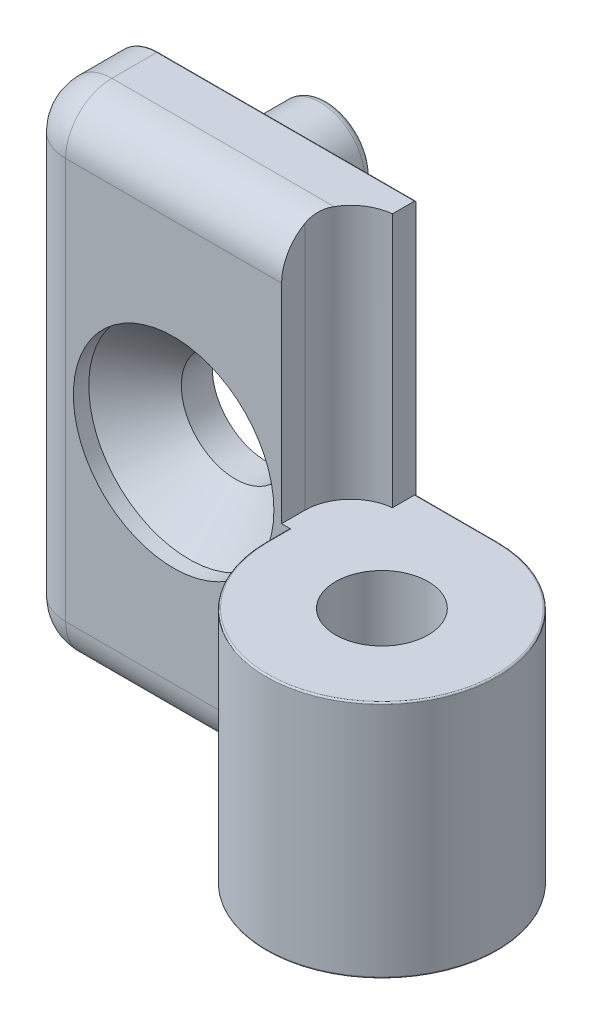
ISO-10303-21;
HEADER;
FILE_DESCRIPTION(('STEP AP214'),'2;1');
FILE_NAME('part.step','',(''),(''),'','','');
FILE_SCHEMA(('AUTOMOTIVE_DESIGN { 1 0 10303 214 1 1 1 1 }'));
ENDSEC;
DATA;
#1=APPLICATION_CONTEXT('core data for automotive mechanical design processes');
#2=APPLICATION_PROTOCOL_DEFINITION('international standard','automotive_design',2000,#1);
#3=PRODUCT_CONTEXT('',#1,'mechanical');
#4=PRODUCT('Part','Part','',(#3));
#5=PRODUCT_RELATED_PRODUCT_CATEGORY('part','',(#4));
#6=PRODUCT_DEFINITION_FORMATION('','',#4);
#7=PRODUCT_DEFINITION_CONTEXT('part definition',#1,'design');
#8=PRODUCT_DEFINITION('design','',#6,#7);
#9=PRODUCT_DEFINITION_SHAPE('','',#8);
#10=(LENGTH_UNIT() NAMED_UNIT(*) SI_UNIT(.MILLI.,.METRE.));
#11=(NAMED_UNIT(*) PLANE_ANGLE_UNIT() SI_UNIT($,.RADIAN.));
#12=(NAMED_UNIT(*) SI_UNIT($,.STERADIAN.) SOLID_ANGLE_UNIT());
#13=UNCERTAINTY_MEASURE_WITH_UNIT(LENGTH_MEASURE(1.E-05),#10,'distance_accuracy_value','');
#14=(GEOMETRIC_REPRESENTATION_CONTEXT(3) GLOBAL_UNCERTAINTY_ASSIGNED_CONTEXT((#13)) GLOBAL_UNIT_ASSIGNED_CONTEXT((#10,
#11,#12)) REPRESENTATION_CONTEXT('',''));
#15=CARTESIAN_POINT('',(0.,0.,0.));
#16=DIRECTION('',(0.,0.,1.));
#17=DIRECTION('',(1.,0.,0.));
#18=AXIS2_PLACEMENT_3D('',#15,#16,#17);
#19=CARTESIAN_POINT('',(-7.59999999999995,15.5,-7.49999999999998));
#20=DIRECTION('',(0.,0.,1.));
#21=DIRECTION('',(1.,0.,0.));
#22=AXIS2_PLACEMENT_3D('',#19,#20,#21);
#23=PLANE('',#22);
#24=CARTESIAN_POINT('',(-15.0000000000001,16.,-7.49999999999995));
#25=DIRECTION('',(0.,0.,1.));
#26=DIRECTION('',(1.,0.,0.));
#27=AXIS2_PLACEMENT_3D('',#24,#25,#26);
#28=CIRCLE('',#27,3.5);
#29=CARTESIAN_POINT('',(-11.5000000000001,16.,-7.49999999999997));
#30=VERTEX_POINT('',#29);
#31=EDGE_CURVE('E180',#30,#30,#28,.T.);
#32=ORIENTED_EDGE('',*,*,#31,.T.);
#33=EDGE_LOOP('',(#32));
#34=FACE_BOUND('',#33,.T.);
#35=CARTESIAN_POINT('',(-15.0000000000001,28.,-7.49999999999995));
#36=DIRECTION('',(0.,0.,1.));
#37=DIRECTION('',(1.,0.,0.));
#38=AXIS2_PLACEMENT_3D('',#35,#36,#37);
#39=CIRCLE('',#38,2.9);
#40=CARTESIAN_POINT('',(-12.1000000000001,28.,-7.49999999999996));
#41=VERTEX_POINT('',#40);
#42=EDGE_CURVE('E228',#41,#41,#39,.F.);
#43=ORIENTED_EDGE('',*,*,#42,.F.);
#44=EDGE_LOOP('',(#43));
#45=FACE_BOUND('',#44,.T.);
#46=CARTESIAN_POINT('',(-22.0000000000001,29.,-7.49999999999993));
#47=DIRECTION('',(0.,0.,1.));
#48=DIRECTION('',(1.,0.,0.));
#49=AXIS2_PLACEMENT_3D('',#46,#47,#48);
#50=CIRCLE('',#49,2.9);
#51=CARTESIAN_POINT('',(-24.9000000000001,29.,-7.49999999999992));
#52=VERTEX_POINT('',#51);
#53=CARTESIAN_POINT('',(-22.0000000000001,31.9,-7.49999999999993));
#54=VERTEX_POINT('',#53);
#55=EDGE_CURVE('E459',#52,#54,#50,.F.);
#56=ORIENTED_EDGE('',*,*,#55,.T.);
#57=DIRECTION('',(1.,0.,0.));
#58=VECTOR('',#57,1.);
#59=CARTESIAN_POINT('',(-5.30000000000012,31.9,-7.49999999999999));
#60=LINE('',#59,#58);
#61=CARTESIAN_POINT('',(-5.30000000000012,31.9,-7.49999999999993));
#62=VERTEX_POINT('',#61);
#63=EDGE_CURVE('E461',#54,#62,#60,.T.);
#64=ORIENTED_EDGE('',*,*,#63,.T.);
#65=DIRECTION('',(0.,-1.,0.));
#66=VECTOR('',#65,1.);
#67=CARTESIAN_POINT('',(-5.30000000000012,32.,-7.49999999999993));
#68=LINE('',#67,#66);
#69=CARTESIAN_POINT('',(-5.30000000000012,15.4,-7.49999999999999));
#70=VERTEX_POINT('',#69);
#71=EDGE_CURVE('E207',#62,#70,#68,.T.);
#72=ORIENTED_EDGE('',*,*,#71,.T.);
#73=DIRECTION('',(-1.,0.,0.));
#74=VECTOR('',#73,1.);
#75=CARTESIAN_POINT('',(-7.59999999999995,15.4,-7.49999999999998));
#76=LINE('',#75,#74);
#77=CARTESIAN_POINT('',(0.,15.4,-7.50000000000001));
#78=VERTEX_POINT('',#77);
#79=EDGE_CURVE('E450',#70,#78,#76,.F.);
#80=ORIENTED_EDGE('',*,*,#79,.T.);
#81=DIRECTION('',(0.,-1.,0.));
#82=VECTOR('',#81,1.);
#83=CARTESIAN_POINT('',(0.,15.5,-7.50000000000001));
#84=LINE('',#83,#82);
#85=CARTESIAN_POINT('',(0.,0.0999999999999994,-7.50000000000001));
#86=VERTEX_POINT('',#85);
#87=EDGE_CURVE('E223',#78,#86,#84,.T.);
#88=ORIENTED_EDGE('',*,*,#87,.T.);
#89=DIRECTION('',(-1.,0.,0.));
#90=VECTOR('',#89,1.);
#91=CARTESIAN_POINT('',(-22.0000000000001,0.0999999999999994,-7.49999999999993));
#92=LINE('',#91,#90);
#93=CARTESIAN_POINT('',(-22.0000000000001,0.0999999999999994,-7.49999999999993));
#94=VERTEX_POINT('',#93);
#95=EDGE_CURVE('E445',#86,#94,#92,.T.);
#96=ORIENTED_EDGE('',*,*,#95,.T.);
#97=CARTESIAN_POINT('',(-22.0000000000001,3.,-7.49999999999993));
#98=DIRECTION('',(0.,0.,1.));
#99=DIRECTION('',(1.,0.,0.));
#100=AXIS2_PLACEMENT_3D('',#97,#98,#99);
#101=CIRCLE('',#100,2.9);
#102=CARTESIAN_POINT('',(-24.9000000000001,3.,-7.49999999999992));
#103=VERTEX_POINT('',#102);
#104=EDGE_CURVE('E449',#94,#103,#101,.F.);
#105=ORIENTED_EDGE('',*,*,#104,.T.);
#106=DIRECTION('',(0.,-1.,0.));
#107=VECTOR('',#106,1.);
#108=CARTESIAN_POINT('',(-24.9000000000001,29.,-7.49999999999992));
#109=LINE('',#108,#107);
#110=EDGE_CURVE('E452',#103,#52,#109,.F.);
#111=ORIENTED_EDGE('',*,*,#110,.T.);
#112=EDGE_LOOP('',(#56,#64,#72,#80,#88,#96,#105,#111));
#113=FACE_BOUND('',#112,.T.);
#114=CARTESIAN_POINT('',(-15.0000000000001,4.,-7.49999999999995));
#115=DIRECTION('',(0.,0.,1.));
#116=DIRECTION('',(1.,0.,0.));
#117=AXIS2_PLACEMENT_3D('',#114,#115,#116);
#118=CIRCLE('',#117,2.9);
#119=CARTESIAN_POINT('',(-12.1000000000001,4.,-7.49999999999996));
#120=VERTEX_POINT('',#119);
#121=EDGE_CURVE('E231',#120,#120,#118,.F.);
#122=ORIENTED_EDGE('',*,*,#121,.F.);
#123=EDGE_LOOP('',(#122));
#124=FACE_BOUND('',#123,.T.);
#125=ADVANCED_FACE('F37',(#34,#45,#113,#124),#23,.F.);
#126=CARTESIAN_POINT('',(0.,15.5,0.));
#127=DIRECTION('',(0.,-1.,0.));
#128=DIRECTION('',(0.,0.,-1.));
#129=AXIS2_PLACEMENT_3D('',#126,#127,#128);
#130=CYLINDRICAL_SURFACE('',#129,7.49999999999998);
#131=DIRECTION('',(0.,-1.,0.));
#132=VECTOR('',#131,1.);
#133=CARTESIAN_POINT('',(-7.49999999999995,15.5,0.));
#134=LINE('',#133,#132);
#135=CARTESIAN_POINT('',(-7.49999999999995,15.4,0.));
#136=VERTEX_POINT('',#135);
#137=CARTESIAN_POINT('',(-7.49999999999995,0.0999999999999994,0.));
#138=VERTEX_POINT('',#137);
#139=EDGE_CURVE('E216',#136,#138,#134,.T.);
#140=ORIENTED_EDGE('',*,*,#139,.T.);
#141=CARTESIAN_POINT('',(0.,0.0999999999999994,0.));
#142=DIRECTION('',(0.,-1.,0.));
#143=DIRECTION('',(0.,0.,-1.));
#144=AXIS2_PLACEMENT_3D('',#141,#142,#143);
#145=CIRCLE('',#144,7.49999999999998);
#146=EDGE_CURVE('E367',#138,#86,#145,.F.);
#147=ORIENTED_EDGE('',*,*,#146,.T.);
#148=ORIENTED_EDGE('',*,*,#87,.F.);
#149=CARTESIAN_POINT('',(0.,15.4,0.));
#150=DIRECTION('',(0.,-1.,0.));
#151=DIRECTION('',(0.,0.,-1.));
#152=AXIS2_PLACEMENT_3D('',#149,#150,#151);
#153=CIRCLE('',#152,7.49999999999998);
#154=EDGE_CURVE('E413',#78,#136,#153,.T.);
#155=ORIENTED_EDGE('',*,*,#154,.T.);
#156=EDGE_LOOP('',(#140,#147,#148,#155));
#157=FACE_BOUND('',#156,.T.);
#158=ADVANCED_FACE('F327',(#157),#130,.T.);
#159=CARTESIAN_POINT('',(-7.59999999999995,15.5,-1.49999999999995));
#160=DIRECTION('',(0.,0.,-1.));
#161=DIRECTION('',(-1.,0.,0.));
#162=AXIS2_PLACEMENT_3D('',#159,#160,#161);
#163=PLANE('',#162);
#164=CARTESIAN_POINT('',(-15.0000000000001,16.,-1.49999999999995));
#165=DIRECTION('',(0.,0.,1.));
#166=DIRECTION('',(1.,0.,0.));
#167=AXIS2_PLACEMENT_3D('',#164,#165,#166);
#168=CIRCLE('',#167,6.5);
#169=CARTESIAN_POINT('',(-8.50000000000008,16.,-1.49999999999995));
#170=VERTEX_POINT('',#169);
#171=EDGE_CURVE('E533',#170,#170,#168,.T.);
#172=ORIENTED_EDGE('',*,*,#171,.F.);
#173=EDGE_LOOP('',(#172));
#174=FACE_BOUND('',#173,.T.);
#175=DIRECTION('',(0.,-1.,0.));
#176=VECTOR('',#175,1.);
#177=CARTESIAN_POINT('',(-22.0000000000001,32.,-1.49999999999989));
#178=LINE('',#177,#176);
#179=CARTESIAN_POINT('',(-22.0000000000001,29.,-1.49999999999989));
#180=VERTEX_POINT('',#179);
#181=CARTESIAN_POINT('',(-22.0000000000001,3.,-1.49999999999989));
#182=VERTEX_POINT('',#181);
#183=EDGE_CURVE('E204',#180,#182,#178,.T.);
#184=ORIENTED_EDGE('',*,*,#183,.T.);
#185=DIRECTION('',(1.,0.,0.));
#186=VECTOR('',#185,1.);
#187=CARTESIAN_POINT('',(-7.49999999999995,3.,-1.49999999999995));
#188=LINE('',#187,#186);
#189=CARTESIAN_POINT('',(-7.49999999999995,3.,-1.49999999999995));
#190=VERTEX_POINT('',#189);
#191=EDGE_CURVE('E269',#182,#190,#188,.T.);
#192=ORIENTED_EDGE('',*,*,#191,.T.);
#193=DIRECTION('',(0.,-1.,0.));
#194=VECTOR('',#193,1.);
#195=CARTESIAN_POINT('',(-7.49999999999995,15.5,-1.49999999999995));
#196=LINE('',#195,#194);
#197=CARTESIAN_POINT('',(-7.49999999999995,15.4,-1.49999999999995));
#198=VERTEX_POINT('',#197);
#199=EDGE_CURVE('E221',#198,#190,#196,.T.);
#200=ORIENTED_EDGE('',*,*,#199,.F.);
#201=CARTESIAN_POINT('',(-7.39999999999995,15.4,-1.49999999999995));
#202=DIRECTION('',(0.,0.,-1.));
#203=DIRECTION('',(-1.,0.,0.));
#204=AXIS2_PLACEMENT_3D('',#201,#202,#203);
#205=CIRCLE('',#204,0.1);
#206=CARTESIAN_POINT('',(-7.39999999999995,15.5,-1.49999999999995));
#207=VERTEX_POINT('',#206);
#208=EDGE_CURVE('E46',#198,#207,#205,.T.);
#209=ORIENTED_EDGE('',*,*,#208,.T.);
#210=DIRECTION('',(1.,0.,0.));
#211=VECTOR('',#210,1.);
#212=CARTESIAN_POINT('',(-7.59999999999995,15.5,-1.49999999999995));
#213=LINE('',#212,#211);
#214=CARTESIAN_POINT('',(-8.00000000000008,15.5,-1.49999999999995));
#215=VERTEX_POINT('',#214);
#216=EDGE_CURVE('E54',#215,#207,#213,.T.);
#217=ORIENTED_EDGE('',*,*,#216,.F.);
#218=DIRECTION('',(0.,1.,0.));
#219=VECTOR('',#218,1.);
#220=CARTESIAN_POINT('',(-8.00000000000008,15.5,-1.49999999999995));
#221=LINE('',#220,#219);
#222=CARTESIAN_POINT('',(-8.00000000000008,29.,-1.49999999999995));
#223=VERTEX_POINT('',#222);
#224=EDGE_CURVE('E190',#215,#223,#221,.T.);
#225=ORIENTED_EDGE('',*,*,#224,.T.);
#226=DIRECTION('',(-1.,0.,0.));
#227=VECTOR('',#226,1.);
#228=CARTESIAN_POINT('',(-22.0000000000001,29.,-1.49999999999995));
#229=LINE('',#228,#227);
#230=EDGE_CURVE('E267',#223,#180,#229,.T.);
#231=ORIENTED_EDGE('',*,*,#230,.T.);
#232=EDGE_LOOP('',(#184,#192,#200,#209,#217,#225,#231));
#233=FACE_BOUND('',#232,.T.);
#234=ADVANCED_FACE('F323',(#174,#233),#163,.F.);
#235=CARTESIAN_POINT('',(-7.49999999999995,15.5,0.));
#236=DIRECTION('',(1.,0.,0.));
#237=DIRECTION('',(0.,0.,-1.));
#238=AXIS2_PLACEMENT_3D('',#235,#236,#237);
#239=PLANE('',#238);
#240=CARTESIAN_POINT('',(-7.49999999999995,3.,-4.49999999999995));
#241=DIRECTION('',(1.,0.,0.));
#242=DIRECTION('',(0.,0.,-1.));
#243=AXIS2_PLACEMENT_3D('',#240,#241,#242);
#244=CIRCLE('',#243,3.);
#245=CARTESIAN_POINT('',(-7.49999999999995,0.0999999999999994,-3.73188542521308));
#246=VERTEX_POINT('',#245);
#247=EDGE_CURVE('E516',#190,#246,#244,.T.);
#248=ORIENTED_EDGE('',*,*,#247,.T.);
#249=DIRECTION('',(0.,0.,1.));
#250=VECTOR('',#249,1.);
#251=CARTESIAN_POINT('',(-7.49999999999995,0.0999999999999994,0.));
#252=LINE('',#251,#250);
#253=EDGE_CURVE('E515',#246,#138,#252,.T.);
#254=ORIENTED_EDGE('',*,*,#253,.T.);
#255=ORIENTED_EDGE('',*,*,#139,.F.);
#256=DIRECTION('',(0.,0.,1.));
#257=VECTOR('',#256,1.);
#258=CARTESIAN_POINT('',(-7.49999999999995,15.4,0.));
#259=LINE('',#258,#257);
#260=EDGE_CURVE('E513',#136,#198,#259,.F.);
#261=ORIENTED_EDGE('',*,*,#260,.T.);
#262=ORIENTED_EDGE('',*,*,#199,.T.);
#263=EDGE_LOOP('',(#248,#254,#255,#261,#262));
#264=FACE_BOUND('',#263,.T.);
#265=ADVANCED_FACE('F317',(#264),#239,.F.);
#266=CARTESIAN_POINT('',(0.,15.5,0.));
#267=DIRECTION('',(0.,-1.,0.));
#268=DIRECTION('',(0.,0.,-1.));
#269=AXIS2_PLACEMENT_3D('',#266,#267,#268);
#270=PLANE('',#269);
#271=ORIENTED_EDGE('',*,*,#216,.T.);
#272=DIRECTION('',(0.,0.,1.));
#273=VECTOR('',#272,1.);
#274=CARTESIAN_POINT('',(-7.39999999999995,15.5,0.));
#275=LINE('',#274,#273);
#276=CARTESIAN_POINT('',(-7.39999999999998,15.5,0.));
#277=VERTEX_POINT('',#276);
#278=EDGE_CURVE('E476',#207,#277,#275,.T.);
#279=ORIENTED_EDGE('',*,*,#278,.T.);
#280=CARTESIAN_POINT('',(0.,15.5,0.));
#281=DIRECTION('',(0.,-1.,0.));
#282=DIRECTION('',(0.,0.,-1.));
#283=AXIS2_PLACEMENT_3D('',#280,#281,#282);
#284=CIRCLE('',#283,7.39999999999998);
#285=CARTESIAN_POINT('',(0.,15.5,-7.39999999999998));
#286=VERTEX_POINT('',#285);
#287=EDGE_CURVE('E60',#277,#286,#284,.F.);
#288=ORIENTED_EDGE('',*,*,#287,.T.);
#289=DIRECTION('',(-1.,0.,0.));
#290=VECTOR('',#289,1.);
#291=CARTESIAN_POINT('',(0.,15.5,-7.40000000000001));
#292=LINE('',#291,#290);
#293=CARTESIAN_POINT('',(-5.30000000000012,15.5,-7.39999999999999));
#294=VERTEX_POINT('',#293);
#295=EDGE_CURVE('E474',#286,#294,#292,.T.);
#296=ORIENTED_EDGE('',*,*,#295,.T.);
#297=DIRECTION('',(0.,0.,1.));
#298=VECTOR('',#297,1.);
#299=CARTESIAN_POINT('',(-5.30000000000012,15.5,0.));
#300=LINE('',#299,#298);
#301=CARTESIAN_POINT('',(-5.30000000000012,15.5,-5.98496231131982));
#302=VERTEX_POINT('',#301);
#303=EDGE_CURVE('E176',#294,#302,#300,.T.);
#304=ORIENTED_EDGE('',*,*,#303,.T.);
#305=CARTESIAN_POINT('',(-5.00000000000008,15.5,-2.99999999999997));
#306=DIRECTION('',(0.,1.,0.));
#307=DIRECTION('',(0.,0.,1.));
#308=AXIS2_PLACEMENT_3D('',#305,#306,#307);
#309=CIRCLE('',#308,3.);
#310=CARTESIAN_POINT('',(-8.00000000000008,15.5,-2.99999999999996));
#311=VERTEX_POINT('',#310);
#312=EDGE_CURVE('E169',#302,#311,#309,.T.);
#313=ORIENTED_EDGE('',*,*,#312,.T.);
#314=DIRECTION('',(0.,0.,1.));
#315=VECTOR('',#314,1.);
#316=CARTESIAN_POINT('',(-8.00000000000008,15.5,-2.99999999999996));
#317=LINE('',#316,#315);
#318=EDGE_CURVE('E174',#311,#215,#317,.T.);
#319=ORIENTED_EDGE('',*,*,#318,.T.);
#320=EDGE_LOOP('',(#271,#279,#288,#296,#304,#313,#319));
#321=FACE_BOUND('',#320,.T.);
#322=CARTESIAN_POINT('',(0.,15.5,0.));
#323=DIRECTION('',(0.,1.,0.));
#324=DIRECTION('',(0.,0.,1.));
#325=AXIS2_PLACEMENT_3D('',#322,#323,#324);
#326=CIRCLE('',#325,3.);
#327=CARTESIAN_POINT('',(0.,15.5,3.));
#328=VERTEX_POINT('',#327);
#329=EDGE_CURVE('E212',#328,#328,#326,.T.);
#330=ORIENTED_EDGE('',*,*,#329,.F.);
#331=EDGE_LOOP('',(#330));
#332=FACE_BOUND('',#331,.T.);
#333=ADVANCED_FACE('F171',(#321,#332),#270,.F.);
#334=CARTESIAN_POINT('',(0.,0.,0.));
#335=DIRECTION('',(0.,-1.,0.));
#336=DIRECTION('',(0.,0.,-1.));
#337=AXIS2_PLACEMENT_3D('',#334,#335,#336);
#338=PLANE('',#337);
#339=DIRECTION('',(0.,0.,1.));
#340=VECTOR('',#339,1.);
#341=CARTESIAN_POINT('',(-7.39999999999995,0.,-4.49999999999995));
#342=LINE('',#341,#340);
#343=CARTESIAN_POINT('',(-7.39999999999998,0.,0.));
#344=VERTEX_POINT('',#343);
#345=CARTESIAN_POINT('',(-7.39999999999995,0.,-4.49999999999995));
#346=VERTEX_POINT('',#345);
#347=EDGE_CURVE('E454',#344,#346,#342,.F.);
#348=ORIENTED_EDGE('',*,*,#347,.T.);
#349=DIRECTION('',(1.,0.,0.));
#350=VECTOR('',#349,1.);
#351=CARTESIAN_POINT('',(-22.0000000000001,0.,-4.49999999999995));
#352=LINE('',#351,#350);
#353=CARTESIAN_POINT('',(-22.0000000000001,0.,-4.49999999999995));
#354=VERTEX_POINT('',#353);
#355=EDGE_CURVE('E246',#346,#354,#352,.F.);
#356=ORIENTED_EDGE('',*,*,#355,.T.);
#357=DIRECTION('',(0.,0.,-1.));
#358=VECTOR('',#357,1.);
#359=CARTESIAN_POINT('',(-22.0000000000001,0.,0.));
#360=LINE('',#359,#358);
#361=CARTESIAN_POINT('',(-22.0000000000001,0.,-7.39999999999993));
#362=VERTEX_POINT('',#361);
#363=EDGE_CURVE('E251',#354,#362,#360,.T.);
#364=ORIENTED_EDGE('',*,*,#363,.T.);
#365=DIRECTION('',(-1.,0.,0.));
#366=VECTOR('',#365,1.);
#367=CARTESIAN_POINT('',(0.,0.,-7.40000000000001));
#368=LINE('',#367,#366);
#369=CARTESIAN_POINT('',(0.,0.,-7.39999999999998));
#370=VERTEX_POINT('',#369);
#371=EDGE_CURVE('E444',#362,#370,#368,.F.);
#372=ORIENTED_EDGE('',*,*,#371,.T.);
#373=CARTESIAN_POINT('',(0.,0.,0.));
#374=DIRECTION('',(0.,-1.,0.));
#375=DIRECTION('',(0.,0.,-1.));
#376=AXIS2_PLACEMENT_3D('',#373,#374,#375);
#377=CIRCLE('',#376,7.39999999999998);
#378=EDGE_CURVE('E441',#370,#344,#377,.T.);
#379=ORIENTED_EDGE('',*,*,#378,.T.);
#380=EDGE_LOOP('',(#348,#356,#364,#372,#379));
#381=FACE_BOUND('',#380,.T.);
#382=ADVANCED_FACE('F313',(#381),#338,.T.);
#383=CARTESIAN_POINT('',(0.,2.,0.));
#384=DIRECTION('',(0.,1.,0.));
#385=DIRECTION('',(0.,0.,1.));
#386=AXIS2_PLACEMENT_3D('',#383,#384,#385);
#387=CYLINDRICAL_SURFACE('',#386,3.);
#388=CARTESIAN_POINT('',(0.,2.,0.));
#389=DIRECTION('',(0.,1.,0.));
#390=DIRECTION('',(0.,0.,1.));
#391=AXIS2_PLACEMENT_3D('',#388,#389,#390);
#392=CIRCLE('',#391,3.);
#393=CARTESIAN_POINT('',(0.,2.,3.));
#394=VERTEX_POINT('',#393);
#395=EDGE_CURVE('E213',#394,#394,#392,.T.);
#396=ORIENTED_EDGE('',*,*,#395,.F.);
#397=EDGE_LOOP('',(#396));
#398=FACE_BOUND('',#397,.T.);
#399=ORIENTED_EDGE('',*,*,#329,.T.);
#400=EDGE_LOOP('',(#399));
#401=FACE_BOUND('',#400,.T.);
#402=ADVANCED_FACE('F309',(#398,#401),#387,.F.);
#403=CARTESIAN_POINT('',(0.,2.,0.));
#404=DIRECTION('',(0.,1.,0.));
#405=DIRECTION('',(0.,0.,1.));
#406=AXIS2_PLACEMENT_3D('',#403,#404,#405);
#407=PLANE('',#406);
#408=ORIENTED_EDGE('',*,*,#395,.T.);
#409=EDGE_LOOP('',(#408));
#410=FACE_BOUND('',#409,.T.);
#411=ADVANCED_FACE('F299',(#410),#407,.T.);
#412=CARTESIAN_POINT('',(-5.30000000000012,32.,-1.49999999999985));
#413=DIRECTION('',(1.,0.,0.));
#414=DIRECTION('',(0.,0.,-1.));
#415=AXIS2_PLACEMENT_3D('',#412,#413,#414);
#416=PLANE('',#415);
#417=ORIENTED_EDGE('',*,*,#71,.F.);
#418=CARTESIAN_POINT('',(-5.30000000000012,31.9,-7.39999999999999));
#419=DIRECTION('',(1.,0.,0.));
#420=DIRECTION('',(0.,0.,-1.));
#421=AXIS2_PLACEMENT_3D('',#418,#419,#420);
#422=CIRCLE('',#421,0.1);
#423=CARTESIAN_POINT('',(-5.30000000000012,32.,-7.39999999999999));
#424=VERTEX_POINT('',#423);
#425=EDGE_CURVE('E463',#62,#424,#422,.T.);
#426=ORIENTED_EDGE('',*,*,#425,.T.);
#427=DIRECTION('',(0.,0.,1.));
#428=VECTOR('',#427,1.);
#429=CARTESIAN_POINT('',(-5.30000000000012,32.,-1.49999999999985));
#430=LINE('',#429,#428);
#431=CARTESIAN_POINT('',(-5.30000000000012,32.,-5.98496231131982));
#432=VERTEX_POINT('',#431);
#433=EDGE_CURVE('E201',#424,#432,#430,.T.);
#434=ORIENTED_EDGE('',*,*,#433,.T.);
#435=DIRECTION('',(0.,1.,0.));
#436=VECTOR('',#435,1.);
#437=CARTESIAN_POINT('',(-5.30000000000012,15.5,-5.98496231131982));
#438=LINE('',#437,#436);
#439=EDGE_CURVE('E198',#302,#432,#438,.T.);
#440=ORIENTED_EDGE('',*,*,#439,.F.);
#441=ORIENTED_EDGE('',*,*,#303,.F.);
#442=CARTESIAN_POINT('',(-5.30000000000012,15.4,-7.39999999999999));
#443=DIRECTION('',(1.,0.,0.));
#444=DIRECTION('',(0.,0.,-1.));
#445=AXIS2_PLACEMENT_3D('',#442,#443,#444);
#446=CIRCLE('',#445,0.1);
#447=EDGE_CURVE('E11',#294,#70,#446,.F.);
#448=ORIENTED_EDGE('',*,*,#447,.T.);
#449=EDGE_LOOP('',(#417,#426,#434,#440,#441,#448));
#450=FACE_BOUND('',#449,.T.);
#451=ADVANCED_FACE('F295',(#450),#416,.T.);
#452=CARTESIAN_POINT('',(-22.0000000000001,32.,-4.49999999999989));
#453=DIRECTION('',(0.,-1.,0.));
#454=DIRECTION('',(0.,0.,-1.));
#455=AXIS2_PLACEMENT_3D('',#452,#453,#454);
#456=CYLINDRICAL_SURFACE('',#455,3.);
#457=DIRECTION('',(0.,-1.,0.));
#458=VECTOR('',#457,1.);
#459=CARTESIAN_POINT('',(-25.0000000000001,32.,-4.49999999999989));
#460=LINE('',#459,#458);
#461=CARTESIAN_POINT('',(-25.0000000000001,29.,-4.49999999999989));
#462=VERTEX_POINT('',#461);
#463=CARTESIAN_POINT('',(-25.0000000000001,3.,-4.49999999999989));
#464=VERTEX_POINT('',#463);
#465=EDGE_CURVE('E203',#462,#464,#460,.T.);
#466=ORIENTED_EDGE('',*,*,#465,.T.);
#467=CARTESIAN_POINT('',(-22.0000000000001,3.,-4.49999999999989));
#468=DIRECTION('',(0.,-1.,0.));
#469=DIRECTION('',(0.,0.,-1.));
#470=AXIS2_PLACEMENT_3D('',#467,#468,#469);
#471=CIRCLE('',#470,3.);
#472=EDGE_CURVE('E261',#464,#182,#471,.F.);
#473=ORIENTED_EDGE('',*,*,#472,.T.);
#474=ORIENTED_EDGE('',*,*,#183,.F.);
#475=CARTESIAN_POINT('',(-22.0000000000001,29.,-4.49999999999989));
#476=DIRECTION('',(0.,-1.,0.));
#477=DIRECTION('',(0.,0.,-1.));
#478=AXIS2_PLACEMENT_3D('',#475,#476,#477);
#479=CIRCLE('',#478,3.);
#480=EDGE_CURVE('E259',#180,#462,#479,.T.);
#481=ORIENTED_EDGE('',*,*,#480,.T.);
#482=EDGE_LOOP('',(#466,#473,#474,#481));
#483=FACE_BOUND('',#482,.T.);
#484=ADVANCED_FACE('F298',(#483),#456,.T.);
#485=CARTESIAN_POINT('',(-25.0000000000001,32.,-4.49999999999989));
#486=DIRECTION('',(-1.,0.,0.));
#487=DIRECTION('',(0.,0.,1.));
#488=AXIS2_PLACEMENT_3D('',#485,#486,#487);
#489=PLANE('',#488);
#490=DIRECTION('',(0.,0.,-1.));
#491=VECTOR('',#490,1.);
#492=CARTESIAN_POINT('',(-25.0000000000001,29.,-4.49999999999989));
#493=LINE('',#492,#491);
#494=CARTESIAN_POINT('',(-25.0000000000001,29.,-7.39999999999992));
#495=VERTEX_POINT('',#494);
#496=EDGE_CURVE('E254',#462,#495,#493,.T.);
#497=ORIENTED_EDGE('',*,*,#496,.T.);
#498=DIRECTION('',(0.,-1.,0.));
#499=VECTOR('',#498,1.);
#500=CARTESIAN_POINT('',(-25.0000000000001,3.,-7.39999999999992));
#501=LINE('',#500,#499);
#502=CARTESIAN_POINT('',(-25.0000000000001,3.,-7.39999999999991));
#503=VERTEX_POINT('',#502);
#504=EDGE_CURVE('E469',#495,#503,#501,.T.);
#505=ORIENTED_EDGE('',*,*,#504,.T.);
#506=DIRECTION('',(0.,0.,-1.));
#507=VECTOR('',#506,1.);
#508=CARTESIAN_POINT('',(-25.0000000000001,3.,-4.49999999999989));
#509=LINE('',#508,#507);
#510=EDGE_CURVE('E257',#503,#464,#509,.F.);
#511=ORIENTED_EDGE('',*,*,#510,.T.);
#512=ORIENTED_EDGE('',*,*,#465,.F.);
#513=EDGE_LOOP('',(#497,#505,#511,#512));
#514=FACE_BOUND('',#513,.T.);
#515=ADVANCED_FACE('F293',(#514),#489,.T.);
#516=CARTESIAN_POINT('',(-22.0000000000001,32.,-4.49999999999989));
#517=DIRECTION('',(0.,1.,0.));
#518=DIRECTION('',(0.,0.,1.));
#519=AXIS2_PLACEMENT_3D('',#516,#517,#518);
#520=PLANE('',#519);
#521=ORIENTED_EDGE('',*,*,#433,.F.);
#522=DIRECTION('',(1.,0.,0.));
#523=VECTOR('',#522,1.);
#524=CARTESIAN_POINT('',(-22.0000000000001,32.,-7.39999999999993));
#525=LINE('',#524,#523);
#526=CARTESIAN_POINT('',(-22.0000000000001,32.,-7.39999999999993));
#527=VERTEX_POINT('',#526);
#528=EDGE_CURVE('E465',#424,#527,#525,.F.);
#529=ORIENTED_EDGE('',*,*,#528,.T.);
#530=DIRECTION('',(0.,0.,-1.));
#531=VECTOR('',#530,1.);
#532=CARTESIAN_POINT('',(-22.0000000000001,32.,-4.49999999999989));
#533=LINE('',#532,#531);
#534=CARTESIAN_POINT('',(-22.0000000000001,32.,-4.49999999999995));
#535=VERTEX_POINT('',#534);
#536=EDGE_CURVE('E265',#527,#535,#533,.F.);
#537=ORIENTED_EDGE('',*,*,#536,.T.);
#538=DIRECTION('',(-1.,0.,0.));
#539=VECTOR('',#538,1.);
#540=CARTESIAN_POINT('',(-8.00000000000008,32.,-4.49999999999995));
#541=LINE('',#540,#539);
#542=CARTESIAN_POINT('',(-7.59807621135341,32.,-4.49999999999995));
#543=VERTEX_POINT('',#542);
#544=EDGE_CURVE('E263',#535,#543,#541,.F.);
#545=ORIENTED_EDGE('',*,*,#544,.T.);
#546=CARTESIAN_POINT('',(-5.00000000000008,32.,-2.99999999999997));
#547=DIRECTION('',(0.,1.,0.));
#548=DIRECTION('',(0.,0.,1.));
#549=AXIS2_PLACEMENT_3D('',#546,#547,#548);
#550=CIRCLE('',#549,3.);
#551=EDGE_CURVE('E226',#432,#543,#550,.T.);
#552=ORIENTED_EDGE('',*,*,#551,.F.);
#553=EDGE_LOOP('',(#521,#529,#537,#545,#552));
#554=FACE_BOUND('',#553,.T.);
#555=ADVANCED_FACE('F290',(#554),#520,.T.);
#556=CARTESIAN_POINT('',(-8.00000000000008,15.5,-2.99999999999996));
#557=DIRECTION('',(-1.,0.,0.));
#558=DIRECTION('',(0.,0.,1.));
#559=AXIS2_PLACEMENT_3D('',#556,#557,#558);
#560=PLANE('',#559);
#561=DIRECTION('',(0.,1.,0.));
#562=VECTOR('',#561,1.);
#563=CARTESIAN_POINT('',(-8.00000000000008,15.5,-2.99999999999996));
#564=LINE('',#563,#562);
#565=CARTESIAN_POINT('',(-8.00000000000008,31.5980762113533,-2.99999999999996));
#566=VERTEX_POINT('',#565);
#567=EDGE_CURVE('E183',#311,#566,#564,.T.);
#568=ORIENTED_EDGE('',*,*,#567,.T.);
#569=CARTESIAN_POINT('',(-8.00000000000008,29.,-4.49999999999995));
#570=DIRECTION('',(-1.,0.,0.));
#571=DIRECTION('',(0.,0.,1.));
#572=AXIS2_PLACEMENT_3D('',#569,#570,#571);
#573=CIRCLE('',#572,3.);
#574=EDGE_CURVE('E278',#566,#223,#573,.F.);
#575=ORIENTED_EDGE('',*,*,#574,.T.);
#576=ORIENTED_EDGE('',*,*,#224,.F.);
#577=ORIENTED_EDGE('',*,*,#318,.F.);
#578=EDGE_LOOP('',(#568,#575,#576,#577));
#579=FACE_BOUND('',#578,.T.);
#580=ADVANCED_FACE('F192',(#579),#560,.F.);
#581=CARTESIAN_POINT('',(-5.00000000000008,15.5,-2.99999999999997));
#582=DIRECTION('',(0.,1.,0.));
#583=DIRECTION('',(0.,0.,1.));
#584=AXIS2_PLACEMENT_3D('',#581,#582,#583);
#585=CYLINDRICAL_SURFACE('',#584,3.);
#586=ORIENTED_EDGE('',*,*,#551,.T.);
#587=CARTESIAN_POINT('',(-7.59807621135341,32.,-4.49999999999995));
#588=CARTESIAN_POINT('',(-7.62988153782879,32.0000087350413,-4.44493424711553));
#589=CARTESIAN_POINT('',(-7.65992254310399,31.9984838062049,-4.3888355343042));
#590=CARTESIAN_POINT('',(-7.71632995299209,31.9920904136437,-4.27497922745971));
#591=CARTESIAN_POINT('',(-7.74269488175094,31.9872206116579,-4.21722097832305));
#592=CARTESIAN_POINT('',(-7.79157242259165,31.9738624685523,-4.10051183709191));
#593=CARTESIAN_POINT('',(-7.81408598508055,31.965375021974,-4.04156124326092));
#594=CARTESIAN_POINT('',(-7.8551763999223,31.9446035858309,-3.92299061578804));
#595=CARTESIAN_POINT('',(-7.87375409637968,31.9323204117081,-3.86337072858));
#596=CARTESIAN_POINT('',(-7.92362207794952,31.8894923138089,-3.68396374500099));
#597=CARTESIAN_POINT('',(-7.94895852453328,31.8529917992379,-3.56384396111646));
#598=CARTESIAN_POINT('',(-7.98445398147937,31.7642902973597,-3.327568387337));
#599=CARTESIAN_POINT('',(-7.99464917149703,31.7121270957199,-3.21140379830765));
#600=CARTESIAN_POINT('',(-7.99891590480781,31.6439914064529,-3.08237184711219));
#601=CARTESIAN_POINT('',(-7.99932471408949,31.635022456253,-3.06577028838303));
#602=CARTESIAN_POINT('',(-7.99986635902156,31.6167793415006,-3.0327511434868));
#603=CARTESIAN_POINT('',(-7.99999944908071,31.607505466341,-3.01633340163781));
#604=CARTESIAN_POINT('',(-8.00000000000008,31.5980762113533,-2.99999999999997));
#605=B_SPLINE_CURVE_WITH_KNOTS('',3,(#587,#588,#589,#590,#591,#592,#593,#594,#595,#596,#597,
#598,#599,#600,#601,#602,#603,#604),.UNSPECIFIED.,.F.,.F.,(4,2,2,2,2,2,2,2,4),(0.,
0.190739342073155,0.381555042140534,0.572323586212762,0.763051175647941,1.14519682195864,
1.52642786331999,1.58304875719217,1.63961738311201),.UNSPECIFIED.);
#606=EDGE_CURVE('E187',#543,#566,#605,.T.);
#607=ORIENTED_EDGE('',*,*,#606,.T.);
#608=ORIENTED_EDGE('',*,*,#567,.F.);
#609=ORIENTED_EDGE('',*,*,#312,.F.);
#610=ORIENTED_EDGE('',*,*,#439,.T.);
#611=EDGE_LOOP('',(#586,#607,#608,#609,#610));
#612=FACE_BOUND('',#611,.T.);
#613=ADVANCED_FACE('F185',(#612),#585,.F.);
#614=CARTESIAN_POINT('',(-15.0000000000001,28.,-11.5));
#615=DIRECTION('',(0.,0.,1.));
#616=DIRECTION('',(1.,0.,0.));
#617=AXIS2_PLACEMENT_3D('',#614,#615,#616);
#618=CYLINDRICAL_SURFACE('',#617,2.9);
#619=CARTESIAN_POINT('',(-15.0000000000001,28.,-11.));
#620=DIRECTION('',(0.,0.,-1.));
#621=DIRECTION('',(-1.,0.,0.));
#622=AXIS2_PLACEMENT_3D('',#619,#620,#621);
#623=CIRCLE('',#622,2.9);
#624=CARTESIAN_POINT('',(-17.9000000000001,28.,-10.9999999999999));
#625=VERTEX_POINT('',#624);
#626=EDGE_CURVE('E237',#625,#625,#623,.F.);
#627=ORIENTED_EDGE('',*,*,#626,.T.);
#628=EDGE_LOOP('',(#627));
#629=FACE_BOUND('',#628,.T.);
#630=ORIENTED_EDGE('',*,*,#42,.T.);
#631=EDGE_LOOP('',(#630));
#632=FACE_BOUND('',#631,.T.);
#633=ADVANCED_FACE('F288',(#629,#632),#618,.T.);
#634=CARTESIAN_POINT('',(-15.0000000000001,28.,-11.5));
#635=DIRECTION('',(0.,0.,-1.));
#636=DIRECTION('',(-1.,0.,0.));
#637=AXIS2_PLACEMENT_3D('',#634,#635,#636);
#638=PLANE('',#637);
#639=CARTESIAN_POINT('',(-15.0000000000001,28.,-11.5));
#640=DIRECTION('',(0.,0.,-1.));
#641=DIRECTION('',(-1.,0.,0.));
#642=AXIS2_PLACEMENT_3D('',#639,#640,#641);
#643=CIRCLE('',#642,2.);
#644=CARTESIAN_POINT('',(-17.0000000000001,28.,-11.4999999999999));
#645=VERTEX_POINT('',#644);
#646=EDGE_CURVE('E507',#645,#645,#643,.T.);
#647=ORIENTED_EDGE('',*,*,#646,.F.);
#648=EDGE_LOOP('',(#647));
#649=FACE_BOUND('',#648,.T.);
#650=CARTESIAN_POINT('',(-15.0000000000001,28.,-11.5));
#651=DIRECTION('',(0.,0.,-1.));
#652=DIRECTION('',(-1.,0.,0.));
#653=AXIS2_PLACEMENT_3D('',#650,#651,#652);
#654=CIRCLE('',#653,2.4);
#655=CARTESIAN_POINT('',(-17.4000000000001,28.,-11.4999999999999));
#656=VERTEX_POINT('',#655);
#657=EDGE_CURVE('E234',#656,#656,#654,.T.);
#658=ORIENTED_EDGE('',*,*,#657,.T.);
#659=EDGE_LOOP('',(#658));
#660=FACE_BOUND('',#659,.T.);
#661=ADVANCED_FACE('F570',(#649,#660),#638,.T.);
#662=CARTESIAN_POINT('',(-15.0000000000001,4.,-11.5));
#663=DIRECTION('',(0.,0.,1.));
#664=DIRECTION('',(1.,0.,0.));
#665=AXIS2_PLACEMENT_3D('',#662,#663,#664);
#666=CYLINDRICAL_SURFACE('',#665,2.9);
#667=CARTESIAN_POINT('',(-15.0000000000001,4.,-11.));
#668=DIRECTION('',(0.,0.,-1.));
#669=DIRECTION('',(-1.,0.,0.));
#670=AXIS2_PLACEMENT_3D('',#667,#668,#669);
#671=CIRCLE('',#670,2.9);
#672=CARTESIAN_POINT('',(-17.9000000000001,4.,-10.9999999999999));
#673=VERTEX_POINT('',#672);
#674=EDGE_CURVE('E243',#673,#673,#671,.F.);
#675=ORIENTED_EDGE('',*,*,#674,.T.);
#676=EDGE_LOOP('',(#675));
#677=FACE_BOUND('',#676,.T.);
#678=ORIENTED_EDGE('',*,*,#121,.T.);
#679=EDGE_LOOP('',(#678));
#680=FACE_BOUND('',#679,.T.);
#681=ADVANCED_FACE('F566',(#677,#680),#666,.T.);
#682=CARTESIAN_POINT('',(-15.0000000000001,4.,-11.5));
#683=DIRECTION('',(0.,0.,-1.));
#684=DIRECTION('',(-1.,0.,0.));
#685=AXIS2_PLACEMENT_3D('',#682,#683,#684);
#686=PLANE('',#685);
#687=CARTESIAN_POINT('',(-15.0000000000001,4.,-11.5));
#688=DIRECTION('',(0.,0.,-1.));
#689=DIRECTION('',(-1.,0.,0.));
#690=AXIS2_PLACEMENT_3D('',#687,#688,#689);
#691=CIRCLE('',#690,2.);
#692=CARTESIAN_POINT('',(-17.0000000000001,4.,-11.4999999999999));
#693=VERTEX_POINT('',#692);
#694=EDGE_CURVE('E425',#693,#693,#691,.T.);
#695=ORIENTED_EDGE('',*,*,#694,.F.);
#696=EDGE_LOOP('',(#695));
#697=FACE_BOUND('',#696,.T.);
#698=CARTESIAN_POINT('',(-15.0000000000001,4.,-11.5));
#699=DIRECTION('',(0.,0.,-1.));
#700=DIRECTION('',(-1.,0.,0.));
#701=AXIS2_PLACEMENT_3D('',#698,#699,#700);
#702=CIRCLE('',#701,2.4);
#703=CARTESIAN_POINT('',(-17.4000000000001,4.,-11.4999999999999));
#704=VERTEX_POINT('',#703);
#705=EDGE_CURVE('E240',#704,#704,#702,.T.);
#706=ORIENTED_EDGE('',*,*,#705,.T.);
#707=EDGE_LOOP('',(#706));
#708=FACE_BOUND('',#707,.T.);
#709=ADVANCED_FACE('F339',(#697,#708),#686,.T.);
#710=CARTESIAN_POINT('',(-15.0000000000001,28.,-11.));
#711=DIRECTION('',(0.,0.,-1.));
#712=DIRECTION('',(-1.,0.,0.));
#713=AXIS2_PLACEMENT_3D('',#710,#711,#712);
#714=TOROIDAL_SURFACE('',#713,2.4,0.5);
#715=ORIENTED_EDGE('',*,*,#626,.F.);
#716=EDGE_LOOP('',(#715));
#717=FACE_BOUND('',#716,.T.);
#718=ORIENTED_EDGE('',*,*,#657,.F.);
#719=EDGE_LOOP('',(#718));
#720=FACE_BOUND('',#719,.T.);
#721=ADVANCED_FACE('F335',(#717,#720),#714,.T.);
#722=CARTESIAN_POINT('',(-15.0000000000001,4.,-11.));
#723=DIRECTION('',(0.,0.,-1.));
#724=DIRECTION('',(-1.,0.,0.));
#725=AXIS2_PLACEMENT_3D('',#722,#723,#724);
#726=TOROIDAL_SURFACE('',#725,2.4,0.5);
#727=ORIENTED_EDGE('',*,*,#674,.F.);
#728=EDGE_LOOP('',(#727));
#729=FACE_BOUND('',#728,.T.);
#730=ORIENTED_EDGE('',*,*,#705,.F.);
#731=EDGE_LOOP('',(#730));
#732=FACE_BOUND('',#731,.T.);
#733=ADVANCED_FACE('F338',(#729,#732),#726,.T.);
#734=CARTESIAN_POINT('',(-15.0000000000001,16.,-1.49999999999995));
#735=DIRECTION('',(0.,0.,1.));
#736=DIRECTION('',(1.,0.,0.));
#737=AXIS2_PLACEMENT_3D('',#734,#735,#736);
#738=CYLINDRICAL_SURFACE('',#737,3.5);
#739=CARTESIAN_POINT('',(-15.0000000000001,16.,-5.49999999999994));
#740=DIRECTION('',(0.,0.,1.));
#741=DIRECTION('',(1.,0.,0.));
#742=AXIS2_PLACEMENT_3D('',#739,#740,#741);
#743=CIRCLE('',#742,3.5);
#744=CARTESIAN_POINT('',(-11.5000000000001,16.,-5.49999999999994));
#745=VERTEX_POINT('',#744);
#746=EDGE_CURVE('E249',#745,#745,#743,.T.);
#747=ORIENTED_EDGE('',*,*,#746,.T.);
#748=EDGE_LOOP('',(#747));
#749=FACE_BOUND('',#748,.T.);
#750=ORIENTED_EDGE('',*,*,#31,.F.);
#751=EDGE_LOOP('',(#750));
#752=FACE_BOUND('',#751,.T.);
#753=ADVANCED_FACE('F343',(#749,#752),#738,.F.);
#754=CARTESIAN_POINT('',(-15.0000000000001,16.,-2.49999999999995));
#755=DIRECTION('',(0.,0.,1.));
#756=DIRECTION('',(1.,0.,0.));
#757=AXIS2_PLACEMENT_3D('',#754,#755,#756);
#758=CONICAL_SURFACE('',#757,6.5,0.785398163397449);
#759=ORIENTED_EDGE('',*,*,#746,.F.);
#760=EDGE_LOOP('',(#759));
#761=FACE_BOUND('',#760,.T.);
#762=CARTESIAN_POINT('',(-15.0000000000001,16.,-2.49999999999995));
#763=DIRECTION('',(0.,0.,1.));
#764=DIRECTION('',(1.,0.,0.));
#765=AXIS2_PLACEMENT_3D('',#762,#763,#764);
#766=CIRCLE('',#765,6.5);
#767=CARTESIAN_POINT('',(-8.50000000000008,16.,-2.49999999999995));
#768=VERTEX_POINT('',#767);
#769=EDGE_CURVE('E536',#768,#768,#766,.T.);
#770=ORIENTED_EDGE('',*,*,#769,.T.);
#771=EDGE_LOOP('',(#770));
#772=FACE_BOUND('',#771,.T.);
#773=ADVANCED_FACE('F548',(#761,#772),#758,.F.);
#774=CARTESIAN_POINT('',(-15.0000000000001,16.,-1.49999999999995));
#775=DIRECTION('',(0.,0.,1.));
#776=DIRECTION('',(1.,0.,0.));
#777=AXIS2_PLACEMENT_3D('',#774,#775,#776);
#778=CYLINDRICAL_SURFACE('',#777,6.5);
#779=ORIENTED_EDGE('',*,*,#769,.F.);
#780=EDGE_LOOP('',(#779));
#781=FACE_BOUND('',#780,.T.);
#782=ORIENTED_EDGE('',*,*,#171,.T.);
#783=EDGE_LOOP('',(#782));
#784=FACE_BOUND('',#783,.T.);
#785=ADVANCED_FACE('F357',(#781,#784),#778,.F.);
#786=CARTESIAN_POINT('',(-7.59999999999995,3.,-4.49999999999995));
#787=DIRECTION('',(-1.,0.,0.));
#788=DIRECTION('',(0.,0.,1.));
#789=AXIS2_PLACEMENT_3D('',#786,#787,#788);
#790=CYLINDRICAL_SURFACE('',#789,3.);
#791=ORIENTED_EDGE('',*,*,#247,.F.);
#792=ORIENTED_EDGE('',*,*,#191,.F.);
#793=CARTESIAN_POINT('',(-22.0000000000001,3.,-4.49999999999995));
#794=DIRECTION('',(-1.,0.,0.));
#795=DIRECTION('',(0.,0.,1.));
#796=AXIS2_PLACEMENT_3D('',#793,#794,#795);
#797=CIRCLE('',#796,3.);
#798=EDGE_CURVE('E510',#354,#182,#797,.T.);
#799=ORIENTED_EDGE('',*,*,#798,.F.);
#800=ORIENTED_EDGE('',*,*,#355,.F.);
#801=CARTESIAN_POINT('',(-7.49999999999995,0.0999999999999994,-3.73188542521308));
#802=CARTESIAN_POINT('',(-7.49995931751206,0.0914367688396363,-3.76421228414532));
#803=CARTESIAN_POINT('',(-7.49890643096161,0.0834229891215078,-3.79665536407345));
#804=CARTESIAN_POINT('',(-7.49522991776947,0.0685033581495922,-3.86169097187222));
#805=CARTESIAN_POINT('',(-7.49260718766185,0.0615968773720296,-3.89428340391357));
#806=CARTESIAN_POINT('',(-7.48488191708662,0.0461723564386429,-3.97354188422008));
#807=CARTESIAN_POINT('',(-7.47919847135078,0.0382295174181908,-4.02026169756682));
#808=CARTESIAN_POINT('',(-7.46633353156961,0.0245828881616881,-4.1138263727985));
#809=CARTESIAN_POINT('',(-7.45915140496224,0.0188800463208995,-4.16067127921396));
#810=CARTESIAN_POINT('',(-7.43622741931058,0.00510101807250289,-4.30135309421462));
#811=CARTESIAN_POINT('',(-7.41910940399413,0.000356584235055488,-4.39532543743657));
#812=CARTESIAN_POINT('',(-7.40131159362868,6.45372220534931E-06,-4.49281589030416));
#813=CARTESIAN_POINT('',(-7.40065576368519,2.7178186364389E-09,-4.49640800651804));
#814=CARTESIAN_POINT('',(-7.39999999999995,0.,-4.49999999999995));
#815=B_SPLINE_CURVE_WITH_KNOTS('',3,(#801,#802,#803,#804,#805,#806,#807,#808,#809,#810,#811,
#812,#813,#814),.UNSPECIFIED.,.F.,.F.,(4,2,2,2,2,2,4),(0.,0.10026555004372,0.200473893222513,
0.34356655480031,0.486719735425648,0.773061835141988,0.784016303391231),.UNSPECIFIED.);
#816=EDGE_CURVE('E361',#346,#246,#815,.F.);
#817=ORIENTED_EDGE('',*,*,#816,.T.);
#818=EDGE_LOOP('',(#791,#792,#799,#800,#817));
#819=FACE_BOUND('',#818,.T.);
#820=ADVANCED_FACE('F352',(#819),#790,.T.);
#821=CARTESIAN_POINT('',(-22.0000000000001,3.,-4.49999999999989));
#822=DIRECTION('',(0.,0.,1.));
#823=DIRECTION('',(1.,0.,0.));
#824=AXIS2_PLACEMENT_3D('',#821,#822,#823);
#825=SPHERICAL_SURFACE('',#824,3.);
#826=ORIENTED_EDGE('',*,*,#798,.T.);
#827=ORIENTED_EDGE('',*,*,#472,.F.);
#828=CARTESIAN_POINT('',(-22.0000000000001,3.,-4.49999999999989));
#829=DIRECTION('',(0.,0.,-1.));
#830=DIRECTION('',(-1.,0.,0.));
#831=AXIS2_PLACEMENT_3D('',#828,#829,#830);
#832=CIRCLE('',#831,3.);
#833=EDGE_CURVE('E500',#354,#464,#832,.T.);
#834=ORIENTED_EDGE('',*,*,#833,.F.);
#835=EDGE_LOOP('',(#826,#827,#834));
#836=FACE_BOUND('',#835,.T.);
#837=ADVANCED_FACE('F348',(#836),#825,.T.);
#838=CARTESIAN_POINT('',(-22.0000000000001,3.,0.));
#839=DIRECTION('',(0.,0.,-1.));
#840=DIRECTION('',(-1.,0.,0.));
#841=AXIS2_PLACEMENT_3D('',#838,#839,#840);
#842=CYLINDRICAL_SURFACE('',#841,3.);
#843=ORIENTED_EDGE('',*,*,#510,.F.);
#844=CARTESIAN_POINT('',(-22.0000000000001,3.,-7.39999999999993));
#845=DIRECTION('',(0.,0.,1.));
#846=DIRECTION('',(1.,0.,0.));
#847=AXIS2_PLACEMENT_3D('',#844,#845,#846);
#848=CIRCLE('',#847,3.);
#849=EDGE_CURVE('E471',#503,#362,#848,.T.);
#850=ORIENTED_EDGE('',*,*,#849,.T.);
#851=ORIENTED_EDGE('',*,*,#363,.F.);
#852=ORIENTED_EDGE('',*,*,#833,.T.);
#853=EDGE_LOOP('',(#843,#850,#851,#852));
#854=FACE_BOUND('',#853,.T.);
#855=ADVANCED_FACE('F345',(#854),#842,.T.);
#856=CARTESIAN_POINT('',(-7.59999999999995,29.,-4.49999999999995));
#857=DIRECTION('',(1.,0.,0.));
#858=DIRECTION('',(0.,0.,-1.));
#859=AXIS2_PLACEMENT_3D('',#856,#857,#858);
#860=CYLINDRICAL_SURFACE('',#859,3.);
#861=CARTESIAN_POINT('',(-22.0000000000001,29.,-4.49999999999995));
#862=DIRECTION('',(-1.,0.,0.));
#863=DIRECTION('',(0.,0.,1.));
#864=AXIS2_PLACEMENT_3D('',#861,#862,#863);
#865=CIRCLE('',#864,3.);
#866=EDGE_CURVE('E492',#180,#535,#865,.T.);
#867=ORIENTED_EDGE('',*,*,#866,.F.);
#868=ORIENTED_EDGE('',*,*,#230,.F.);
#869=ORIENTED_EDGE('',*,*,#574,.F.);
#870=ORIENTED_EDGE('',*,*,#606,.F.);
#871=ORIENTED_EDGE('',*,*,#544,.F.);
#872=EDGE_LOOP('',(#867,#868,#869,#870,#871));
#873=FACE_BOUND('',#872,.T.);
#874=ADVANCED_FACE('F280',(#873),#860,.T.);
#875=CARTESIAN_POINT('',(-22.0000000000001,29.,-4.49999999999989));
#876=DIRECTION('',(0.,0.,1.));
#877=DIRECTION('',(1.,0.,0.));
#878=AXIS2_PLACEMENT_3D('',#875,#876,#877);
#879=SPHERICAL_SURFACE('',#878,3.);
#880=ORIENTED_EDGE('',*,*,#480,.F.);
#881=ORIENTED_EDGE('',*,*,#866,.T.);
#882=CARTESIAN_POINT('',(-22.0000000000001,29.,-4.49999999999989));
#883=DIRECTION('',(0.,0.,-1.));
#884=DIRECTION('',(-1.,0.,0.));
#885=AXIS2_PLACEMENT_3D('',#882,#883,#884);
#886=CIRCLE('',#885,3.);
#887=EDGE_CURVE('E498',#462,#535,#886,.T.);
#888=ORIENTED_EDGE('',*,*,#887,.F.);
#889=EDGE_LOOP('',(#880,#881,#888));
#890=FACE_BOUND('',#889,.T.);
#891=ADVANCED_FACE('F497',(#890),#879,.T.);
#892=CARTESIAN_POINT('',(-22.0000000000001,29.,-4.49999999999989));
#893=DIRECTION('',(0.,0.,-1.));
#894=DIRECTION('',(-1.,0.,0.));
#895=AXIS2_PLACEMENT_3D('',#892,#893,#894);
#896=CYLINDRICAL_SURFACE('',#895,3.);
#897=ORIENTED_EDGE('',*,*,#536,.F.);
#898=CARTESIAN_POINT('',(-22.0000000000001,29.,-7.39999999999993));
#899=DIRECTION('',(0.,0.,1.));
#900=DIRECTION('',(1.,0.,0.));
#901=AXIS2_PLACEMENT_3D('',#898,#899,#900);
#902=CIRCLE('',#901,3.);
#903=EDGE_CURVE('E467',#527,#495,#902,.T.);
#904=ORIENTED_EDGE('',*,*,#903,.T.);
#905=ORIENTED_EDGE('',*,*,#496,.F.);
#906=ORIENTED_EDGE('',*,*,#887,.T.);
#907=EDGE_LOOP('',(#897,#904,#905,#906));
#908=FACE_BOUND('',#907,.T.);
#909=ADVANCED_FACE('F359',(#908),#896,.T.);
#910=CARTESIAN_POINT('',(-15.0000000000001,28.,-3.99999999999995));
#911=DIRECTION('',(0.,0.,-1.));
#912=DIRECTION('',(-1.,0.,0.));
#913=AXIS2_PLACEMENT_3D('',#910,#911,#912);
#914=CYLINDRICAL_SURFACE('',#913,2.);
#915=CARTESIAN_POINT('',(-15.0000000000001,28.,-3.99999999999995));
#916=DIRECTION('',(0.,0.,-1.));
#917=DIRECTION('',(-1.,0.,0.));
#918=AXIS2_PLACEMENT_3D('',#915,#916,#917);
#919=CIRCLE('',#918,2.);
#920=CARTESIAN_POINT('',(-17.0000000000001,28.,-3.99999999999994));
#921=VERTEX_POINT('',#920);
#922=EDGE_CURVE('E504',#921,#921,#919,.T.);
#923=ORIENTED_EDGE('',*,*,#922,.F.);
#924=EDGE_LOOP('',(#923));
#925=FACE_BOUND('',#924,.T.);
#926=ORIENTED_EDGE('',*,*,#646,.T.);
#927=EDGE_LOOP('',(#926));
#928=FACE_BOUND('',#927,.T.);
#929=ADVANCED_FACE('F559',(#925,#928),#914,.F.);
#930=CARTESIAN_POINT('',(-15.0000000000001,28.,-3.99999999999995));
#931=DIRECTION('',(0.,0.,-1.));
#932=DIRECTION('',(-1.,0.,0.));
#933=AXIS2_PLACEMENT_3D('',#930,#931,#932);
#934=PLANE('',#933);
#935=ORIENTED_EDGE('',*,*,#922,.T.);
#936=EDGE_LOOP('',(#935));
#937=FACE_BOUND('',#936,.T.);
#938=ADVANCED_FACE('F678',(#937),#934,.T.);
#939=CARTESIAN_POINT('',(-15.0000000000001,4.,-3.99999999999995));
#940=DIRECTION('',(0.,0.,-1.));
#941=DIRECTION('',(-1.,0.,0.));
#942=AXIS2_PLACEMENT_3D('',#939,#940,#941);
#943=CYLINDRICAL_SURFACE('',#942,2.);
#944=CARTESIAN_POINT('',(-15.0000000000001,4.,-3.99999999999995));
#945=DIRECTION('',(0.,0.,-1.));
#946=DIRECTION('',(-1.,0.,0.));
#947=AXIS2_PLACEMENT_3D('',#944,#945,#946);
#948=CIRCLE('',#947,2.);
#949=CARTESIAN_POINT('',(-17.0000000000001,4.,-3.99999999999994));
#950=VERTEX_POINT('',#949);
#951=EDGE_CURVE('E867',#950,#950,#948,.T.);
#952=ORIENTED_EDGE('',*,*,#951,.F.);
#953=EDGE_LOOP('',(#952));
#954=FACE_BOUND('',#953,.T.);
#955=ORIENTED_EDGE('',*,*,#694,.T.);
#956=EDGE_LOOP('',(#955));
#957=FACE_BOUND('',#956,.T.);
#958=ADVANCED_FACE('F685',(#954,#957),#943,.F.);
#959=CARTESIAN_POINT('',(-15.0000000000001,4.,-3.99999999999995));
#960=DIRECTION('',(0.,0.,-1.));
#961=DIRECTION('',(-1.,0.,0.));
#962=AXIS2_PLACEMENT_3D('',#959,#960,#961);
#963=PLANE('',#962);
#964=ORIENTED_EDGE('',*,*,#951,.T.);
#965=EDGE_LOOP('',(#964));
#966=FACE_BOUND('',#965,.T.);
#967=ADVANCED_FACE('F397',(#966),#963,.T.);
#968=CARTESIAN_POINT('',(-7.59999999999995,31.9,-7.39999999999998));
#969=DIRECTION('',(-1.,0.,0.));
#970=DIRECTION('',(0.,0.,1.));
#971=AXIS2_PLACEMENT_3D('',#968,#969,#970);
#972=CYLINDRICAL_SURFACE('',#971,0.1);
#973=ORIENTED_EDGE('',*,*,#425,.F.);
#974=ORIENTED_EDGE('',*,*,#63,.F.);
#975=CARTESIAN_POINT('',(-22.0000000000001,31.9,-7.39999999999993));
#976=DIRECTION('',(-1.,0.,0.));
#977=DIRECTION('',(0.,0.,1.));
#978=AXIS2_PLACEMENT_3D('',#975,#976,#977);
#979=CIRCLE('',#978,0.1);
#980=EDGE_CURVE('E422',#527,#54,#979,.T.);
#981=ORIENTED_EDGE('',*,*,#980,.F.);
#982=ORIENTED_EDGE('',*,*,#528,.F.);
#983=EDGE_LOOP('',(#973,#974,#981,#982));
#984=FACE_BOUND('',#983,.T.);
#985=ADVANCED_FACE('F393',(#984),#972,.T.);
#986=CARTESIAN_POINT('',(-22.0000000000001,29.,-7.39999999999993));
#987=DIRECTION('',(0.,0.,1.));
#988=DIRECTION('',(1.,0.,0.));
#989=AXIS2_PLACEMENT_3D('',#986,#987,#988);
#990=TOROIDAL_SURFACE('',#989,2.9,0.1);
#991=ORIENTED_EDGE('',*,*,#980,.T.);
#992=ORIENTED_EDGE('',*,*,#55,.F.);
#993=CARTESIAN_POINT('',(-24.9000000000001,29.,-7.39999999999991));
#994=DIRECTION('',(0.,-1.,0.));
#995=DIRECTION('',(0.,0.,-1.));
#996=AXIS2_PLACEMENT_3D('',#993,#994,#995);
#997=CIRCLE('',#996,0.1);
#998=EDGE_CURVE('E426',#495,#52,#997,.T.);
#999=ORIENTED_EDGE('',*,*,#998,.F.);
#1000=ORIENTED_EDGE('',*,*,#903,.F.);
#1001=EDGE_LOOP('',(#991,#992,#999,#1000));
#1002=FACE_BOUND('',#1001,.T.);
#1003=ADVANCED_FACE('F389',(#1002),#990,.T.);
#1004=CARTESIAN_POINT('',(-24.9000000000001,32.,-7.39999999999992));
#1005=DIRECTION('',(0.,1.,0.));
#1006=DIRECTION('',(0.,0.,1.));
#1007=AXIS2_PLACEMENT_3D('',#1004,#1005,#1006);
#1008=CYLINDRICAL_SURFACE('',#1007,0.1);
#1009=ORIENTED_EDGE('',*,*,#998,.T.);
#1010=ORIENTED_EDGE('',*,*,#110,.F.);
#1011=CARTESIAN_POINT('',(-24.9000000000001,3.,-7.39999999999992));
#1012=DIRECTION('',(0.,-1.,0.));
#1013=DIRECTION('',(0.,0.,-1.));
#1014=AXIS2_PLACEMENT_3D('',#1011,#1012,#1013);
#1015=CIRCLE('',#1014,0.1);
#1016=EDGE_CURVE('E429',#503,#103,#1015,.T.);
#1017=ORIENTED_EDGE('',*,*,#1016,.F.);
#1018=ORIENTED_EDGE('',*,*,#504,.F.);
#1019=EDGE_LOOP('',(#1009,#1010,#1017,#1018));
#1020=FACE_BOUND('',#1019,.T.);
#1021=ADVANCED_FACE('F385',(#1020),#1008,.T.);
#1022=CARTESIAN_POINT('',(-22.0000000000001,3.,-7.39999999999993));
#1023=DIRECTION('',(0.,0.,1.));
#1024=DIRECTION('',(1.,0.,0.));
#1025=AXIS2_PLACEMENT_3D('',#1022,#1023,#1024);
#1026=TOROIDAL_SURFACE('',#1025,2.9,0.1);
#1027=ORIENTED_EDGE('',*,*,#1016,.T.);
#1028=ORIENTED_EDGE('',*,*,#104,.F.);
#1029=CARTESIAN_POINT('',(-22.0000000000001,0.1,-7.39999999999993));
#1030=DIRECTION('',(1.,0.,0.));
#1031=DIRECTION('',(0.,0.,-1.));
#1032=AXIS2_PLACEMENT_3D('',#1029,#1030,#1031);
#1033=CIRCLE('',#1032,0.1);
#1034=EDGE_CURVE('E432',#362,#94,#1033,.T.);
#1035=ORIENTED_EDGE('',*,*,#1034,.F.);
#1036=ORIENTED_EDGE('',*,*,#849,.F.);
#1037=EDGE_LOOP('',(#1027,#1028,#1035,#1036));
#1038=FACE_BOUND('',#1037,.T.);
#1039=ADVANCED_FACE('F381',(#1038),#1026,.T.);
#1040=CARTESIAN_POINT('',(-7.59999999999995,0.0999999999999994,-7.39999999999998));
#1041=DIRECTION('',(1.,0.,0.));
#1042=DIRECTION('',(0.,0.,-1.));
#1043=AXIS2_PLACEMENT_3D('',#1040,#1041,#1042);
#1044=CYLINDRICAL_SURFACE('',#1043,0.1);
#1045=ORIENTED_EDGE('',*,*,#1034,.T.);
#1046=ORIENTED_EDGE('',*,*,#95,.F.);
#1047=CARTESIAN_POINT('',(0.,0.1,-7.40000000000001));
#1048=DIRECTION('',(1.,0.,0.));
#1049=DIRECTION('',(0.,0.,-1.));
#1050=AXIS2_PLACEMENT_3D('',#1047,#1048,#1049);
#1051=CIRCLE('',#1050,0.1);
#1052=EDGE_CURVE('E417',#370,#86,#1051,.T.);
#1053=ORIENTED_EDGE('',*,*,#1052,.F.);
#1054=ORIENTED_EDGE('',*,*,#371,.F.);
#1055=EDGE_LOOP('',(#1045,#1046,#1053,#1054));
#1056=FACE_BOUND('',#1055,.T.);
#1057=ADVANCED_FACE('F377',(#1056),#1044,.T.);
#1058=CARTESIAN_POINT('',(0.,0.0999999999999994,0.));
#1059=DIRECTION('',(0.,-1.,0.));
#1060=DIRECTION('',(0.,0.,-1.));
#1061=AXIS2_PLACEMENT_3D('',#1058,#1059,#1060);
#1062=TOROIDAL_SURFACE('',#1061,7.39999999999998,0.1);
#1063=ORIENTED_EDGE('',*,*,#1052,.T.);
#1064=ORIENTED_EDGE('',*,*,#146,.F.);
#1065=CARTESIAN_POINT('',(-7.39999999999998,0.1,0.));
#1066=DIRECTION('',(0.,0.,-1.));
#1067=DIRECTION('',(-1.,0.,0.));
#1068=AXIS2_PLACEMENT_3D('',#1065,#1066,#1067);
#1069=CIRCLE('',#1068,0.1);
#1070=EDGE_CURVE('E415',#344,#138,#1069,.T.);
#1071=ORIENTED_EDGE('',*,*,#1070,.F.);
#1072=ORIENTED_EDGE('',*,*,#378,.F.);
#1073=EDGE_LOOP('',(#1063,#1064,#1071,#1072));
#1074=FACE_BOUND('',#1073,.T.);
#1075=ADVANCED_FACE('F373',(#1074),#1062,.T.);
#1076=CARTESIAN_POINT('',(-7.39999999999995,0.0999999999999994,0.));
#1077=DIRECTION('',(0.,0.,-1.));
#1078=DIRECTION('',(-1.,0.,0.));
#1079=AXIS2_PLACEMENT_3D('',#1076,#1077,#1078);
#1080=CYLINDRICAL_SURFACE('',#1079,0.1);
#1081=ORIENTED_EDGE('',*,*,#816,.F.);
#1082=ORIENTED_EDGE('',*,*,#347,.F.);
#1083=ORIENTED_EDGE('',*,*,#1070,.T.);
#1084=ORIENTED_EDGE('',*,*,#253,.F.);
#1085=EDGE_LOOP('',(#1081,#1082,#1083,#1084));
#1086=FACE_BOUND('',#1085,.T.);
#1087=ADVANCED_FACE('F369',(#1086),#1080,.T.);
#1088=CARTESIAN_POINT('',(0.,15.4,-7.40000000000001));
#1089=DIRECTION('',(-1.,0.,0.));
#1090=DIRECTION('',(0.,0.,1.));
#1091=AXIS2_PLACEMENT_3D('',#1088,#1089,#1090);
#1092=CYLINDRICAL_SURFACE('',#1091,0.1);
#1093=ORIENTED_EDGE('',*,*,#447,.F.);
#1094=ORIENTED_EDGE('',*,*,#295,.F.);
#1095=CARTESIAN_POINT('',(0.,15.4,-7.40000000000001));
#1096=DIRECTION('',(1.,0.,0.));
#1097=DIRECTION('',(0.,0.,-1.));
#1098=AXIS2_PLACEMENT_3D('',#1095,#1096,#1097);
#1099=CIRCLE('',#1098,0.1);
#1100=EDGE_CURVE('E41',#78,#286,#1099,.T.);
#1101=ORIENTED_EDGE('',*,*,#1100,.F.);
#1102=ORIENTED_EDGE('',*,*,#79,.F.);
#1103=EDGE_LOOP('',(#1093,#1094,#1101,#1102));
#1104=FACE_BOUND('',#1103,.T.);
#1105=ADVANCED_FACE('F39',(#1104),#1092,.T.);
#1106=CARTESIAN_POINT('',(0.,15.4,0.));
#1107=DIRECTION('',(0.,-1.,0.));
#1108=DIRECTION('',(0.,0.,-1.));
#1109=AXIS2_PLACEMENT_3D('',#1106,#1107,#1108);
#1110=TOROIDAL_SURFACE('',#1109,7.39999999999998,0.1);
#1111=ORIENTED_EDGE('',*,*,#1100,.T.);
#1112=ORIENTED_EDGE('',*,*,#287,.F.);
#1113=CARTESIAN_POINT('',(-7.39999999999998,15.4,0.));
#1114=DIRECTION('',(0.,0.,-1.));
#1115=DIRECTION('',(-1.,0.,0.));
#1116=AXIS2_PLACEMENT_3D('',#1113,#1114,#1115);
#1117=CIRCLE('',#1116,0.1);
#1118=EDGE_CURVE('E416',#136,#277,#1117,.T.);
#1119=ORIENTED_EDGE('',*,*,#1118,.F.);
#1120=ORIENTED_EDGE('',*,*,#154,.F.);
#1121=EDGE_LOOP('',(#1111,#1112,#1119,#1120));
#1122=FACE_BOUND('',#1121,.T.);
#1123=ADVANCED_FACE('F401',(#1122),#1110,.T.);
#1124=CARTESIAN_POINT('',(-7.39999999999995,15.4,0.));
#1125=DIRECTION('',(0.,0.,1.));
#1126=DIRECTION('',(1.,0.,0.));
#1127=AXIS2_PLACEMENT_3D('',#1124,#1125,#1126);
#1128=CYLINDRICAL_SURFACE('',#1127,0.1);
#1129=ORIENTED_EDGE('',*,*,#208,.F.);
#1130=ORIENTED_EDGE('',*,*,#260,.F.);
#1131=ORIENTED_EDGE('',*,*,#1118,.T.);
#1132=ORIENTED_EDGE('',*,*,#278,.F.);
#1133=EDGE_LOOP('',(#1129,#1130,#1131,#1132));
#1134=FACE_BOUND('',#1133,.T.);
#1135=ADVANCED_FACE('F399',(#1134),#1128,.T.);
#1136=CLOSED_SHELL('',(#125,#158,#234,#265,#333,#382,#402,#411,#451,#484,#515,#555,#580,#613,
#633,#661,#681,#709,#721,#733,#753,#773,#785,#820,#837,#855,#874,#891,#909,#929,#938,#958,#967,
#985,#1003,#1021,#1039,#1057,#1075,#1087,#1105,#1123,#1135));
#1137=MANIFOLD_SOLID_BREP('B2',#1136);
#1138=ADVANCED_BREP_SHAPE_REPRESENTATION('',(#18,#1137),#14);
#1139=SHAPE_DEFINITION_REPRESENTATION(#9,#1138);
ENDSEC;
END-ISO-10303-21;
